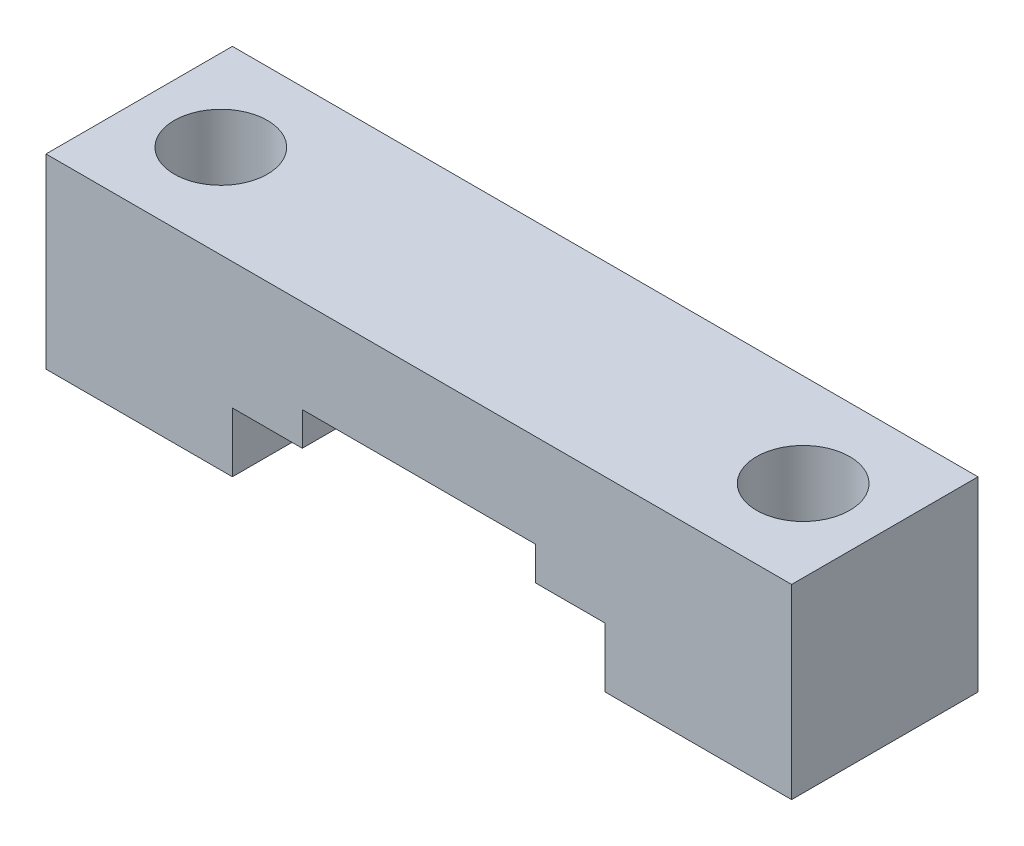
ISO-10303-21;
HEADER;
FILE_DESCRIPTION(('STEP AP214'),'2;1');
FILE_NAME('part.step','',(''),(''),'','','');
FILE_SCHEMA(('AUTOMOTIVE_DESIGN { 1 0 10303 214 1 1 1 1 }'));
ENDSEC;
DATA;
#1=APPLICATION_CONTEXT('core data for automotive mechanical design processes');
#2=APPLICATION_PROTOCOL_DEFINITION('international standard','automotive_design',2000,#1);
#3=PRODUCT_CONTEXT('',#1,'mechanical');
#4=PRODUCT('Part','Part','',(#3));
#5=PRODUCT_RELATED_PRODUCT_CATEGORY('part','',(#4));
#6=PRODUCT_DEFINITION_FORMATION('','',#4);
#7=PRODUCT_DEFINITION_CONTEXT('part definition',#1,'design');
#8=PRODUCT_DEFINITION('design','',#6,#7);
#9=PRODUCT_DEFINITION_SHAPE('','',#8);
#10=(LENGTH_UNIT() NAMED_UNIT(*) SI_UNIT(.MILLI.,.METRE.));
#11=(NAMED_UNIT(*) PLANE_ANGLE_UNIT() SI_UNIT($,.RADIAN.));
#12=(NAMED_UNIT(*) SI_UNIT($,.STERADIAN.) SOLID_ANGLE_UNIT());
#13=UNCERTAINTY_MEASURE_WITH_UNIT(LENGTH_MEASURE(1.E-05),#10,'distance_accuracy_value','');
#14=(GEOMETRIC_REPRESENTATION_CONTEXT(3) GLOBAL_UNCERTAINTY_ASSIGNED_CONTEXT((#13)) GLOBAL_UNIT_ASSIGNED_CONTEXT((#10,
#11,#12)) REPRESENTATION_CONTEXT('',''));
#15=CARTESIAN_POINT('',(0.,0.,0.));
#16=DIRECTION('',(0.,0.,1.));
#17=DIRECTION('',(1.,0.,0.));
#18=AXIS2_PLACEMENT_3D('',#15,#16,#17);
#19=CARTESIAN_POINT('',(-25.4,12.7,6.35));
#20=DIRECTION('',(0.,-1.,0.));
#21=DIRECTION('',(0.,0.,-1.));
#22=AXIS2_PLACEMENT_3D('',#19,#20,#21);
#23=PLANE('',#22);
#24=CARTESIAN_POINT('',(-19.8374,12.7,0.));
#25=DIRECTION('',(0.,-1.,0.));
#26=DIRECTION('',(0.,0.,-1.));
#27=AXIS2_PLACEMENT_3D('',#24,#25,#26);
#28=CIRCLE('',#27,3.175);
#29=CARTESIAN_POINT('',(-19.8374,12.7,-3.175));
#30=VERTEX_POINT('',#29);
#31=EDGE_CURVE('E170',#30,#30,#28,.F.);
#32=ORIENTED_EDGE('',*,*,#31,.F.);
#33=EDGE_LOOP('',(#32));
#34=FACE_BOUND('',#33,.T.);
#35=DIRECTION('',(-1.,0.,0.));
#36=VECTOR('',#35,1.);
#37=CARTESIAN_POINT('',(-25.4,12.7,-6.35));
#38=LINE('',#37,#36);
#39=CARTESIAN_POINT('',(25.4,12.7,-6.35));
#40=VERTEX_POINT('',#39);
#41=CARTESIAN_POINT('',(-25.4,12.7,-6.35));
#42=VERTEX_POINT('',#41);
#43=EDGE_CURVE('E156',#40,#42,#38,.T.);
#44=ORIENTED_EDGE('',*,*,#43,.T.);
#45=DIRECTION('',(0.,0.,-1.));
#46=VECTOR('',#45,1.);
#47=CARTESIAN_POINT('',(-25.4,12.7,6.35));
#48=LINE('',#47,#46);
#49=CARTESIAN_POINT('',(-25.4,12.7,6.35));
#50=VERTEX_POINT('',#49);
#51=EDGE_CURVE('E153',#50,#42,#48,.T.);
#52=ORIENTED_EDGE('',*,*,#51,.F.);
#53=DIRECTION('',(-1.,0.,0.));
#54=VECTOR('',#53,1.);
#55=CARTESIAN_POINT('',(-25.4,12.7,6.35));
#56=LINE('',#55,#54);
#57=CARTESIAN_POINT('',(25.4,12.7,6.35));
#58=VERTEX_POINT('',#57);
#59=EDGE_CURVE('E142',#58,#50,#56,.T.);
#60=ORIENTED_EDGE('',*,*,#59,.F.);
#61=DIRECTION('',(0.,0.,-1.));
#62=VECTOR('',#61,1.);
#63=CARTESIAN_POINT('',(25.4,12.7,6.35));
#64=LINE('',#63,#62);
#65=EDGE_CURVE('E157',#58,#40,#64,.T.);
#66=ORIENTED_EDGE('',*,*,#65,.T.);
#67=EDGE_LOOP('',(#44,#52,#60,#66));
#68=FACE_BOUND('',#67,.T.);
#69=CARTESIAN_POINT('',(19.8374,12.7,0.));
#70=DIRECTION('',(0.,-1.,0.));
#71=DIRECTION('',(0.,0.,-1.));
#72=AXIS2_PLACEMENT_3D('',#69,#70,#71);
#73=CIRCLE('',#72,3.175);
#74=CARTESIAN_POINT('',(19.8374,12.7,-3.175));
#75=VERTEX_POINT('',#74);
#76=EDGE_CURVE('E265',#75,#75,#73,.F.);
#77=ORIENTED_EDGE('',*,*,#76,.F.);
#78=EDGE_LOOP('',(#77));
#79=FACE_BOUND('',#78,.T.);
#80=ADVANCED_FACE('F45',(#34,#68,#79),#23,.F.);
#81=CARTESIAN_POINT('',(25.4,0.,6.35));
#82=DIRECTION('',(0.,1.,0.));
#83=DIRECTION('',(-1.,0.,0.));
#84=AXIS2_PLACEMENT_3D('',#81,#82,#83);
#85=PLANE('',#84);
#86=DIRECTION('',(1.,0.,0.));
#87=VECTOR('',#86,1.);
#88=CARTESIAN_POINT('',(25.4,0.,-6.35));
#89=LINE('',#88,#87);
#90=CARTESIAN_POINT('',(12.7,0.,-6.35));
#91=VERTEX_POINT('',#90);
#92=CARTESIAN_POINT('',(25.4,0.,-6.35));
#93=VERTEX_POINT('',#92);
#94=EDGE_CURVE('E182',#91,#93,#89,.T.);
#95=ORIENTED_EDGE('',*,*,#94,.T.);
#96=DIRECTION('',(0.,0.,-1.));
#97=VECTOR('',#96,1.);
#98=CARTESIAN_POINT('',(25.4,0.,6.35));
#99=LINE('',#98,#97);
#100=CARTESIAN_POINT('',(25.4,0.,6.35));
#101=VERTEX_POINT('',#100);
#102=EDGE_CURVE('E193',#101,#93,#99,.T.);
#103=ORIENTED_EDGE('',*,*,#102,.F.);
#104=DIRECTION('',(1.,0.,0.));
#105=VECTOR('',#104,1.);
#106=CARTESIAN_POINT('',(25.4,0.,6.35));
#107=LINE('',#106,#105);
#108=CARTESIAN_POINT('',(12.7,0.,6.35));
#109=VERTEX_POINT('',#108);
#110=EDGE_CURVE('E242',#109,#101,#107,.T.);
#111=ORIENTED_EDGE('',*,*,#110,.F.);
#112=DIRECTION('',(0.,0.,-1.));
#113=VECTOR('',#112,1.);
#114=CARTESIAN_POINT('',(12.7,0.,6.35));
#115=LINE('',#114,#113);
#116=EDGE_CURVE('E196',#109,#91,#115,.T.);
#117=ORIENTED_EDGE('',*,*,#116,.T.);
#118=EDGE_LOOP('',(#95,#103,#111,#117));
#119=FACE_BOUND('',#118,.T.);
#120=CARTESIAN_POINT('',(19.8374,0.,0.));
#121=DIRECTION('',(0.,1.,0.));
#122=DIRECTION('',(0.,0.,1.));
#123=AXIS2_PLACEMENT_3D('',#120,#121,#122);
#124=CIRCLE('',#123,3.175);
#125=CARTESIAN_POINT('',(19.8374,0.,3.175));
#126=VERTEX_POINT('',#125);
#127=EDGE_CURVE('E270',#126,#126,#124,.T.);
#128=ORIENTED_EDGE('',*,*,#127,.T.);
#129=EDGE_LOOP('',(#128));
#130=FACE_BOUND('',#129,.T.);
#131=ADVANCED_FACE('F248',(#119,#130),#85,.F.);
#132=CARTESIAN_POINT('',(-12.7,0.,6.35));
#133=DIRECTION('',(0.,1.,0.));
#134=DIRECTION('',(-1.,0.,0.));
#135=AXIS2_PLACEMENT_3D('',#132,#133,#134);
#136=PLANE('',#135);
#137=DIRECTION('',(1.,0.,0.));
#138=VECTOR('',#137,1.);
#139=CARTESIAN_POINT('',(-12.7,0.,-6.35));
#140=LINE('',#139,#138);
#141=CARTESIAN_POINT('',(-25.4,0.,-6.35));
#142=VERTEX_POINT('',#141);
#143=CARTESIAN_POINT('',(-12.7,0.,-6.35));
#144=VERTEX_POINT('',#143);
#145=EDGE_CURVE('E109',#142,#144,#140,.T.);
#146=ORIENTED_EDGE('',*,*,#145,.T.);
#147=DIRECTION('',(0.,0.,-1.));
#148=VECTOR('',#147,1.);
#149=CARTESIAN_POINT('',(-12.7,0.,6.35));
#150=LINE('',#149,#148);
#151=CARTESIAN_POINT('',(-12.7,0.,6.35));
#152=VERTEX_POINT('',#151);
#153=EDGE_CURVE('E162',#152,#144,#150,.T.);
#154=ORIENTED_EDGE('',*,*,#153,.F.);
#155=DIRECTION('',(1.,0.,0.));
#156=VECTOR('',#155,1.);
#157=CARTESIAN_POINT('',(-12.7,0.,6.35));
#158=LINE('',#157,#156);
#159=CARTESIAN_POINT('',(-25.4,0.,6.35));
#160=VERTEX_POINT('',#159);
#161=EDGE_CURVE('E62',#160,#152,#158,.T.);
#162=ORIENTED_EDGE('',*,*,#161,.F.);
#163=DIRECTION('',(0.,0.,-1.));
#164=VECTOR('',#163,1.);
#165=CARTESIAN_POINT('',(-25.4,0.,6.35));
#166=LINE('',#165,#164);
#167=EDGE_CURVE('E158',#160,#142,#166,.T.);
#168=ORIENTED_EDGE('',*,*,#167,.T.);
#169=EDGE_LOOP('',(#146,#154,#162,#168));
#170=FACE_BOUND('',#169,.T.);
#171=CARTESIAN_POINT('',(-19.8374,0.,0.));
#172=DIRECTION('',(0.,1.,0.));
#173=DIRECTION('',(0.,0.,1.));
#174=AXIS2_PLACEMENT_3D('',#171,#172,#173);
#175=CIRCLE('',#174,3.175);
#176=CARTESIAN_POINT('',(-19.8374,0.,3.175));
#177=VERTEX_POINT('',#176);
#178=EDGE_CURVE('E263',#177,#177,#175,.T.);
#179=ORIENTED_EDGE('',*,*,#178,.T.);
#180=EDGE_LOOP('',(#179));
#181=FACE_BOUND('',#180,.T.);
#182=ADVANCED_FACE('F257',(#170,#181),#136,.F.);
#183=CARTESIAN_POINT('',(-12.7,4.064,6.35));
#184=DIRECTION('',(-1.,0.,0.));
#185=DIRECTION('',(0.,-1.,0.));
#186=AXIS2_PLACEMENT_3D('',#183,#184,#185);
#187=PLANE('',#186);
#188=DIRECTION('',(0.,1.,0.));
#189=VECTOR('',#188,1.);
#190=CARTESIAN_POINT('',(-12.7,4.064,-6.35));
#191=LINE('',#190,#189);
#192=CARTESIAN_POINT('',(-12.7,4.064,-6.35));
#193=VERTEX_POINT('',#192);
#194=EDGE_CURVE('E166',#144,#193,#191,.T.);
#195=ORIENTED_EDGE('',*,*,#194,.T.);
#196=DIRECTION('',(0.,0.,-1.));
#197=VECTOR('',#196,1.);
#198=CARTESIAN_POINT('',(-12.7,4.064,6.35));
#199=LINE('',#198,#197);
#200=CARTESIAN_POINT('',(-12.7,4.064,6.35));
#201=VERTEX_POINT('',#200);
#202=EDGE_CURVE('E13',#201,#193,#199,.T.);
#203=ORIENTED_EDGE('',*,*,#202,.F.);
#204=DIRECTION('',(0.,1.,0.));
#205=VECTOR('',#204,1.);
#206=CARTESIAN_POINT('',(-12.7,4.064,6.35));
#207=LINE('',#206,#205);
#208=EDGE_CURVE('E189',#152,#201,#207,.T.);
#209=ORIENTED_EDGE('',*,*,#208,.F.);
#210=ORIENTED_EDGE('',*,*,#153,.T.);
#211=EDGE_LOOP('',(#195,#203,#209,#210));
#212=FACE_BOUND('',#211,.T.);
#213=ADVANCED_FACE('F47',(#212),#187,.F.);
#214=CARTESIAN_POINT('',(-12.7,4.064,6.35));
#215=DIRECTION('',(0.,1.,0.));
#216=DIRECTION('',(0.,0.,1.));
#217=AXIS2_PLACEMENT_3D('',#214,#215,#216);
#218=PLANE('',#217);
#219=DIRECTION('',(1.,0.,0.));
#220=VECTOR('',#219,1.);
#221=CARTESIAN_POINT('',(-12.7,4.064,-6.35));
#222=LINE('',#221,#220);
#223=CARTESIAN_POINT('',(-7.9375,4.064,-6.35));
#224=VERTEX_POINT('',#223);
#225=EDGE_CURVE('E169',#193,#224,#222,.T.);
#226=ORIENTED_EDGE('',*,*,#225,.T.);
#227=DIRECTION('',(0.,0.,-1.));
#228=VECTOR('',#227,1.);
#229=CARTESIAN_POINT('',(-7.9375,4.064,6.35));
#230=LINE('',#229,#228);
#231=CARTESIAN_POINT('',(-7.9375,4.064,6.35));
#232=VERTEX_POINT('',#231);
#233=EDGE_CURVE('E54',#232,#224,#230,.T.);
#234=ORIENTED_EDGE('',*,*,#233,.F.);
#235=DIRECTION('',(1.,0.,0.));
#236=VECTOR('',#235,1.);
#237=CARTESIAN_POINT('',(-12.7,4.064,6.35));
#238=LINE('',#237,#236);
#239=EDGE_CURVE('E117',#201,#232,#238,.T.);
#240=ORIENTED_EDGE('',*,*,#239,.F.);
#241=ORIENTED_EDGE('',*,*,#202,.T.);
#242=EDGE_LOOP('',(#226,#234,#240,#241));
#243=FACE_BOUND('',#242,.T.);
#244=ADVANCED_FACE('F309',(#243),#218,.F.);
#245=CARTESIAN_POINT('',(-7.9375,4.064,6.35));
#246=DIRECTION('',(-1.,0.,0.));
#247=DIRECTION('',(0.,0.,1.));
#248=AXIS2_PLACEMENT_3D('',#245,#246,#247);
#249=PLANE('',#248);
#250=DIRECTION('',(0.,1.,0.));
#251=VECTOR('',#250,1.);
#252=CARTESIAN_POINT('',(-7.9375,4.064,-6.35));
#253=LINE('',#252,#251);
#254=CARTESIAN_POINT('',(-7.9375,6.35,-6.35));
#255=VERTEX_POINT('',#254);
#256=EDGE_CURVE('E172',#224,#255,#253,.T.);
#257=ORIENTED_EDGE('',*,*,#256,.T.);
#258=DIRECTION('',(0.,0.,-1.));
#259=VECTOR('',#258,1.);
#260=CARTESIAN_POINT('',(-7.9375,6.35,6.35));
#261=LINE('',#260,#259);
#262=CARTESIAN_POINT('',(-7.9375,6.35,6.35));
#263=VERTEX_POINT('',#262);
#264=EDGE_CURVE('E208',#263,#255,#261,.T.);
#265=ORIENTED_EDGE('',*,*,#264,.F.);
#266=DIRECTION('',(0.,1.,0.));
#267=VECTOR('',#266,1.);
#268=CARTESIAN_POINT('',(-7.9375,4.064,6.35));
#269=LINE('',#268,#267);
#270=EDGE_CURVE('E216',#232,#263,#269,.T.);
#271=ORIENTED_EDGE('',*,*,#270,.F.);
#272=ORIENTED_EDGE('',*,*,#233,.T.);
#273=EDGE_LOOP('',(#257,#265,#271,#272));
#274=FACE_BOUND('',#273,.T.);
#275=ADVANCED_FACE('F214',(#274),#249,.F.);
#276=CARTESIAN_POINT('',(7.9375,6.35,6.35));
#277=DIRECTION('',(0.,1.,0.));
#278=DIRECTION('',(0.,0.,1.));
#279=AXIS2_PLACEMENT_3D('',#276,#277,#278);
#280=PLANE('',#279);
#281=DIRECTION('',(1.,0.,0.));
#282=VECTOR('',#281,1.);
#283=CARTESIAN_POINT('',(7.9375,6.35,-6.35));
#284=LINE('',#283,#282);
#285=CARTESIAN_POINT('',(7.9375,6.35,-6.35));
#286=VERTEX_POINT('',#285);
#287=EDGE_CURVE('E174',#255,#286,#284,.T.);
#288=ORIENTED_EDGE('',*,*,#287,.T.);
#289=DIRECTION('',(0.,0.,-1.));
#290=VECTOR('',#289,1.);
#291=CARTESIAN_POINT('',(7.9375,6.35,6.35));
#292=LINE('',#291,#290);
#293=CARTESIAN_POINT('',(7.9375,6.35,6.35));
#294=VERTEX_POINT('',#293);
#295=EDGE_CURVE('E205',#294,#286,#292,.T.);
#296=ORIENTED_EDGE('',*,*,#295,.F.);
#297=DIRECTION('',(1.,0.,0.));
#298=VECTOR('',#297,1.);
#299=CARTESIAN_POINT('',(7.9375,6.35,6.35));
#300=LINE('',#299,#298);
#301=EDGE_CURVE('E234',#263,#294,#300,.T.);
#302=ORIENTED_EDGE('',*,*,#301,.F.);
#303=ORIENTED_EDGE('',*,*,#264,.T.);
#304=EDGE_LOOP('',(#288,#296,#302,#303));
#305=FACE_BOUND('',#304,.T.);
#306=ADVANCED_FACE('F225',(#305),#280,.F.);
#307=CARTESIAN_POINT('',(7.9375,4.064,6.35));
#308=DIRECTION('',(1.,0.,0.));
#309=DIRECTION('',(0.,0.,-1.));
#310=AXIS2_PLACEMENT_3D('',#307,#308,#309);
#311=PLANE('',#310);
#312=DIRECTION('',(0.,-1.,0.));
#313=VECTOR('',#312,1.);
#314=CARTESIAN_POINT('',(7.9375,4.064,-6.35));
#315=LINE('',#314,#313);
#316=CARTESIAN_POINT('',(7.9375,4.064,-6.35));
#317=VERTEX_POINT('',#316);
#318=EDGE_CURVE('E176',#286,#317,#315,.T.);
#319=ORIENTED_EDGE('',*,*,#318,.T.);
#320=DIRECTION('',(0.,0.,-1.));
#321=VECTOR('',#320,1.);
#322=CARTESIAN_POINT('',(7.9375,4.064,6.35));
#323=LINE('',#322,#321);
#324=CARTESIAN_POINT('',(7.9375,4.064,6.35));
#325=VERTEX_POINT('',#324);
#326=EDGE_CURVE('E202',#325,#317,#323,.T.);
#327=ORIENTED_EDGE('',*,*,#326,.F.);
#328=DIRECTION('',(0.,-1.,0.));
#329=VECTOR('',#328,1.);
#330=CARTESIAN_POINT('',(7.9375,4.064,6.35));
#331=LINE('',#330,#329);
#332=EDGE_CURVE('E231',#294,#325,#331,.T.);
#333=ORIENTED_EDGE('',*,*,#332,.F.);
#334=ORIENTED_EDGE('',*,*,#295,.T.);
#335=EDGE_LOOP('',(#319,#327,#333,#334));
#336=FACE_BOUND('',#335,.T.);
#337=ADVANCED_FACE('F229',(#336),#311,.F.);
#338=CARTESIAN_POINT('',(12.7,4.064,6.35));
#339=DIRECTION('',(0.,1.,0.));
#340=DIRECTION('',(0.,0.,1.));
#341=AXIS2_PLACEMENT_3D('',#338,#339,#340);
#342=PLANE('',#341);
#343=DIRECTION('',(1.,0.,0.));
#344=VECTOR('',#343,1.);
#345=CARTESIAN_POINT('',(12.7,4.064,-6.35));
#346=LINE('',#345,#344);
#347=CARTESIAN_POINT('',(12.7,4.064,-6.35));
#348=VERTEX_POINT('',#347);
#349=EDGE_CURVE('E178',#317,#348,#346,.T.);
#350=ORIENTED_EDGE('',*,*,#349,.T.);
#351=DIRECTION('',(0.,0.,-1.));
#352=VECTOR('',#351,1.);
#353=CARTESIAN_POINT('',(12.7,4.064,6.35));
#354=LINE('',#353,#352);
#355=CARTESIAN_POINT('',(12.7,4.064,6.35));
#356=VERTEX_POINT('',#355);
#357=EDGE_CURVE('E199',#356,#348,#354,.T.);
#358=ORIENTED_EDGE('',*,*,#357,.F.);
#359=DIRECTION('',(1.,0.,0.));
#360=VECTOR('',#359,1.);
#361=CARTESIAN_POINT('',(12.7,4.064,6.35));
#362=LINE('',#361,#360);
#363=EDGE_CURVE('E233',#325,#356,#362,.T.);
#364=ORIENTED_EDGE('',*,*,#363,.F.);
#365=ORIENTED_EDGE('',*,*,#326,.T.);
#366=EDGE_LOOP('',(#350,#358,#364,#365));
#367=FACE_BOUND('',#366,.T.);
#368=ADVANCED_FACE('F299',(#367),#342,.F.);
#369=CARTESIAN_POINT('',(12.7,0.,6.35));
#370=DIRECTION('',(1.,0.,0.));
#371=DIRECTION('',(0.,1.,0.));
#372=AXIS2_PLACEMENT_3D('',#369,#370,#371);
#373=PLANE('',#372);
#374=DIRECTION('',(0.,-1.,0.));
#375=VECTOR('',#374,1.);
#376=CARTESIAN_POINT('',(12.7,0.,-6.35));
#377=LINE('',#376,#375);
#378=EDGE_CURVE('E180',#348,#91,#377,.T.);
#379=ORIENTED_EDGE('',*,*,#378,.T.);
#380=ORIENTED_EDGE('',*,*,#116,.F.);
#381=DIRECTION('',(0.,-1.,0.));
#382=VECTOR('',#381,1.);
#383=CARTESIAN_POINT('',(12.7,0.,6.35));
#384=LINE('',#383,#382);
#385=EDGE_CURVE('E236',#356,#109,#384,.T.);
#386=ORIENTED_EDGE('',*,*,#385,.F.);
#387=ORIENTED_EDGE('',*,*,#357,.T.);
#388=EDGE_LOOP('',(#379,#380,#386,#387));
#389=FACE_BOUND('',#388,.T.);
#390=ADVANCED_FACE('F295',(#389),#373,.F.);
#391=CARTESIAN_POINT('',(25.4,12.7,6.35));
#392=DIRECTION('',(-1.,0.,0.));
#393=DIRECTION('',(0.,0.,1.));
#394=AXIS2_PLACEMENT_3D('',#391,#392,#393);
#395=PLANE('',#394);
#396=DIRECTION('',(0.,1.,0.));
#397=VECTOR('',#396,1.);
#398=CARTESIAN_POINT('',(25.4,12.7,-6.35));
#399=LINE('',#398,#397);
#400=EDGE_CURVE('E184',#93,#40,#399,.T.);
#401=ORIENTED_EDGE('',*,*,#400,.T.);
#402=ORIENTED_EDGE('',*,*,#65,.F.);
#403=DIRECTION('',(0.,1.,0.));
#404=VECTOR('',#403,1.);
#405=CARTESIAN_POINT('',(25.4,12.7,6.35));
#406=LINE('',#405,#404);
#407=EDGE_CURVE('E148',#101,#58,#406,.T.);
#408=ORIENTED_EDGE('',*,*,#407,.F.);
#409=ORIENTED_EDGE('',*,*,#102,.T.);
#410=EDGE_LOOP('',(#401,#402,#408,#409));
#411=FACE_BOUND('',#410,.T.);
#412=ADVANCED_FACE('F253',(#411),#395,.F.);
#413=CARTESIAN_POINT('',(-25.4,0.,6.35));
#414=DIRECTION('',(1.,0.,0.));
#415=DIRECTION('',(0.,0.,-1.));
#416=AXIS2_PLACEMENT_3D('',#413,#414,#415);
#417=PLANE('',#416);
#418=DIRECTION('',(0.,-1.,0.));
#419=VECTOR('',#418,1.);
#420=CARTESIAN_POINT('',(-25.4,0.,-6.35));
#421=LINE('',#420,#419);
#422=EDGE_CURVE('E103',#42,#142,#421,.T.);
#423=ORIENTED_EDGE('',*,*,#422,.T.);
#424=ORIENTED_EDGE('',*,*,#167,.F.);
#425=DIRECTION('',(0.,-1.,0.));
#426=VECTOR('',#425,1.);
#427=CARTESIAN_POINT('',(-25.4,0.,6.35));
#428=LINE('',#427,#426);
#429=EDGE_CURVE('E146',#50,#160,#428,.T.);
#430=ORIENTED_EDGE('',*,*,#429,.F.);
#431=ORIENTED_EDGE('',*,*,#51,.T.);
#432=EDGE_LOOP('',(#423,#424,#430,#431));
#433=FACE_BOUND('',#432,.T.);
#434=ADVANCED_FACE('F160',(#433),#417,.F.);
#435=CARTESIAN_POINT('',(0.,0.,6.35));
#436=DIRECTION('',(0.,0.,-1.));
#437=DIRECTION('',(-1.,0.,0.));
#438=AXIS2_PLACEMENT_3D('',#435,#436,#437);
#439=PLANE('',#438);
#440=ORIENTED_EDGE('',*,*,#208,.T.);
#441=ORIENTED_EDGE('',*,*,#239,.T.);
#442=ORIENTED_EDGE('',*,*,#270,.T.);
#443=ORIENTED_EDGE('',*,*,#301,.T.);
#444=ORIENTED_EDGE('',*,*,#332,.T.);
#445=ORIENTED_EDGE('',*,*,#363,.T.);
#446=ORIENTED_EDGE('',*,*,#385,.T.);
#447=ORIENTED_EDGE('',*,*,#110,.T.);
#448=ORIENTED_EDGE('',*,*,#407,.T.);
#449=ORIENTED_EDGE('',*,*,#59,.T.);
#450=ORIENTED_EDGE('',*,*,#429,.T.);
#451=ORIENTED_EDGE('',*,*,#161,.T.);
#452=EDGE_LOOP('',(#440,#441,#442,#443,#444,#445,#446,#447,#448,#449,#450,#451));
#453=FACE_BOUND('',#452,.T.);
#454=ADVANCED_FACE('F144',(#453),#439,.F.);
#455=CARTESIAN_POINT('',(0.,0.,-6.35));
#456=DIRECTION('',(0.,0.,-1.));
#457=DIRECTION('',(-1.,0.,0.));
#458=AXIS2_PLACEMENT_3D('',#455,#456,#457);
#459=PLANE('',#458);
#460=ORIENTED_EDGE('',*,*,#194,.F.);
#461=ORIENTED_EDGE('',*,*,#145,.F.);
#462=ORIENTED_EDGE('',*,*,#422,.F.);
#463=ORIENTED_EDGE('',*,*,#43,.F.);
#464=ORIENTED_EDGE('',*,*,#400,.F.);
#465=ORIENTED_EDGE('',*,*,#94,.F.);
#466=ORIENTED_EDGE('',*,*,#378,.F.);
#467=ORIENTED_EDGE('',*,*,#349,.F.);
#468=ORIENTED_EDGE('',*,*,#318,.F.);
#469=ORIENTED_EDGE('',*,*,#287,.F.);
#470=ORIENTED_EDGE('',*,*,#256,.F.);
#471=ORIENTED_EDGE('',*,*,#225,.F.);
#472=EDGE_LOOP('',(#460,#461,#462,#463,#464,#465,#466,#467,#468,#469,#470,#471));
#473=FACE_BOUND('',#472,.T.);
#474=ADVANCED_FACE('F220',(#473),#459,.T.);
#475=CARTESIAN_POINT('',(-19.8374,25.4,0.));
#476=DIRECTION('',(0.,-1.,0.));
#477=DIRECTION('',(0.,0.,-1.));
#478=AXIS2_PLACEMENT_3D('',#475,#476,#477);
#479=CYLINDRICAL_SURFACE('',#478,3.175);
#480=ORIENTED_EDGE('',*,*,#178,.F.);
#481=EDGE_LOOP('',(#480));
#482=FACE_BOUND('',#481,.T.);
#483=ORIENTED_EDGE('',*,*,#31,.T.);
#484=EDGE_LOOP('',(#483));
#485=FACE_BOUND('',#484,.T.);
#486=ADVANCED_FACE('F281',(#482,#485),#479,.F.);
#487=CARTESIAN_POINT('',(19.8374,25.4,0.));
#488=DIRECTION('',(0.,-1.,0.));
#489=DIRECTION('',(0.,0.,-1.));
#490=AXIS2_PLACEMENT_3D('',#487,#488,#489);
#491=CYLINDRICAL_SURFACE('',#490,3.175);
#492=ORIENTED_EDGE('',*,*,#127,.F.);
#493=EDGE_LOOP('',(#492));
#494=FACE_BOUND('',#493,.T.);
#495=ORIENTED_EDGE('',*,*,#76,.T.);
#496=EDGE_LOOP('',(#495));
#497=FACE_BOUND('',#496,.T.);
#498=ADVANCED_FACE('F278',(#494,#497),#491,.F.);
#499=CLOSED_SHELL('',(#80,#131,#182,#213,#244,#275,#306,#337,#368,#390,#412,#434,#454,#474,#486,#498));
#500=MANIFOLD_SOLID_BREP('B2',#499);
#501=ADVANCED_BREP_SHAPE_REPRESENTATION('',(#18,#500),#14);
#502=SHAPE_DEFINITION_REPRESENTATION(#9,#501);
ENDSEC;
END-ISO-10303-21;
